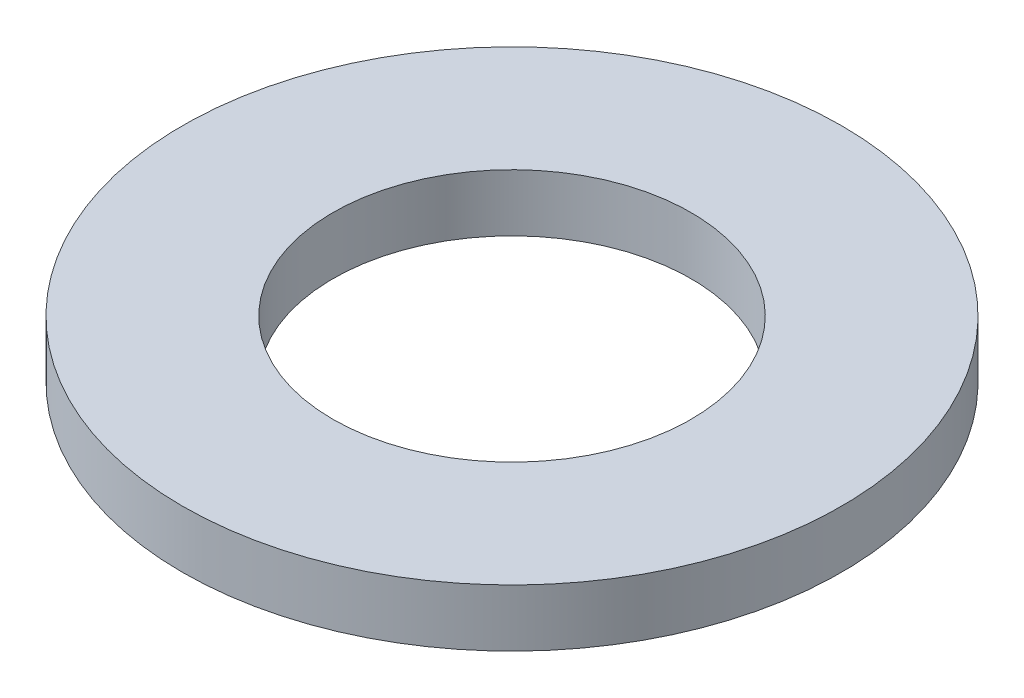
ISO-10303-21;
HEADER;
FILE_DESCRIPTION(('STEP AP214'),'2;1');
FILE_NAME('part.step','',(''),(''),'','','');
FILE_SCHEMA(('AUTOMOTIVE_DESIGN { 1 0 10303 214 1 1 1 1 }'));
ENDSEC;
DATA;
#1=APPLICATION_CONTEXT('core data for automotive mechanical design processes');
#2=APPLICATION_PROTOCOL_DEFINITION('international standard','automotive_design',2000,#1);
#3=PRODUCT_CONTEXT('',#1,'mechanical');
#4=PRODUCT('Part','Part','',(#3));
#5=PRODUCT_RELATED_PRODUCT_CATEGORY('part','',(#4));
#6=PRODUCT_DEFINITION_FORMATION('','',#4);
#7=PRODUCT_DEFINITION_CONTEXT('part definition',#1,'design');
#8=PRODUCT_DEFINITION('design','',#6,#7);
#9=PRODUCT_DEFINITION_SHAPE('','',#8);
#10=(LENGTH_UNIT() NAMED_UNIT(*) SI_UNIT(.MILLI.,.METRE.));
#11=(NAMED_UNIT(*) PLANE_ANGLE_UNIT() SI_UNIT($,.RADIAN.));
#12=(NAMED_UNIT(*) SI_UNIT($,.STERADIAN.) SOLID_ANGLE_UNIT());
#13=UNCERTAINTY_MEASURE_WITH_UNIT(LENGTH_MEASURE(1.E-05),#10,'distance_accuracy_value','');
#14=(GEOMETRIC_REPRESENTATION_CONTEXT(3) GLOBAL_UNCERTAINTY_ASSIGNED_CONTEXT((#13)) GLOBAL_UNIT_ASSIGNED_CONTEXT((#10,
#11,#12)) REPRESENTATION_CONTEXT('',''));
#15=CARTESIAN_POINT('',(0.,0.,0.));
#16=DIRECTION('',(0.,0.,1.));
#17=DIRECTION('',(1.,0.,0.));
#18=AXIS2_PLACEMENT_3D('',#15,#16,#17);
#19=CARTESIAN_POINT('',(0.,8.,0.));
#20=DIRECTION('',(0.,1.,0.));
#21=DIRECTION('',(0.,0.,1.));
#22=AXIS2_PLACEMENT_3D('',#19,#20,#21);
#23=PLANE('',#22);
#24=CARTESIAN_POINT('',(0.,8.,0.));
#25=DIRECTION('',(0.,1.,0.));
#26=DIRECTION('',(0.,0.,1.));
#27=AXIS2_PLACEMENT_3D('',#24,#25,#26);
#28=CIRCLE('',#27,46.);
#29=CARTESIAN_POINT('',(0.,8.,46.));
#30=VERTEX_POINT('',#29);
#31=EDGE_CURVE('E10',#30,#30,#28,.T.);
#32=ORIENTED_EDGE('',*,*,#31,.T.);
#33=EDGE_LOOP('',(#32));
#34=FACE_BOUND('',#33,.T.);
#35=CARTESIAN_POINT('',(0.,8.,0.));
#36=DIRECTION('',(0.,1.,0.));
#37=DIRECTION('',(0.,0.,1.));
#38=AXIS2_PLACEMENT_3D('',#35,#36,#37);
#39=CIRCLE('',#38,25.);
#40=CARTESIAN_POINT('',(0.,8.,25.));
#41=VERTEX_POINT('',#40);
#42=EDGE_CURVE('E39',#41,#41,#39,.T.);
#43=ORIENTED_EDGE('',*,*,#42,.F.);
#44=EDGE_LOOP('',(#43));
#45=FACE_BOUND('',#44,.T.);
#46=ADVANCED_FACE('F28',(#34,#45),#23,.T.);
#47=CARTESIAN_POINT('',(0.,0.,0.));
#48=DIRECTION('',(0.,1.,0.));
#49=DIRECTION('',(0.,0.,1.));
#50=AXIS2_PLACEMENT_3D('',#47,#48,#49);
#51=PLANE('',#50);
#52=CARTESIAN_POINT('',(0.,0.,0.));
#53=DIRECTION('',(0.,1.,0.));
#54=DIRECTION('',(0.,0.,1.));
#55=AXIS2_PLACEMENT_3D('',#52,#53,#54);
#56=CIRCLE('',#55,46.);
#57=CARTESIAN_POINT('',(0.,0.,46.));
#58=VERTEX_POINT('',#57);
#59=EDGE_CURVE('E35',#58,#58,#56,.T.);
#60=ORIENTED_EDGE('',*,*,#59,.F.);
#61=EDGE_LOOP('',(#60));
#62=FACE_BOUND('',#61,.T.);
#63=CARTESIAN_POINT('',(0.,0.,0.));
#64=DIRECTION('',(0.,1.,0.));
#65=DIRECTION('',(0.,0.,1.));
#66=AXIS2_PLACEMENT_3D('',#63,#64,#65);
#67=CIRCLE('',#66,25.);
#68=CARTESIAN_POINT('',(0.,0.,25.));
#69=VERTEX_POINT('',#68);
#70=EDGE_CURVE('E43',#69,#69,#67,.T.);
#71=ORIENTED_EDGE('',*,*,#70,.T.);
#72=EDGE_LOOP('',(#71));
#73=FACE_BOUND('',#72,.T.);
#74=ADVANCED_FACE('F49',(#62,#73),#51,.F.);
#75=CARTESIAN_POINT('',(0.,8.,0.));
#76=DIRECTION('',(0.,-1.,0.));
#77=DIRECTION('',(0.,0.,-1.));
#78=AXIS2_PLACEMENT_3D('',#75,#76,#77);
#79=CYLINDRICAL_SURFACE('',#78,46.);
#80=ORIENTED_EDGE('',*,*,#31,.F.);
#81=EDGE_LOOP('',(#80));
#82=FACE_BOUND('',#81,.T.);
#83=ORIENTED_EDGE('',*,*,#59,.T.);
#84=EDGE_LOOP('',(#83));
#85=FACE_BOUND('',#84,.T.);
#86=ADVANCED_FACE('F30',(#82,#85),#79,.T.);
#87=CARTESIAN_POINT('',(0.,8.,0.));
#88=DIRECTION('',(0.,-1.,0.));
#89=DIRECTION('',(0.,0.,-1.));
#90=AXIS2_PLACEMENT_3D('',#87,#88,#89);
#91=CYLINDRICAL_SURFACE('',#90,25.);
#92=ORIENTED_EDGE('',*,*,#42,.T.);
#93=EDGE_LOOP('',(#92));
#94=FACE_BOUND('',#93,.T.);
#95=ORIENTED_EDGE('',*,*,#70,.F.);
#96=EDGE_LOOP('',(#95));
#97=FACE_BOUND('',#96,.T.);
#98=ADVANCED_FACE('F51',(#94,#97),#91,.F.);
#99=CLOSED_SHELL('',(#46,#74,#86,#98));
#100=MANIFOLD_SOLID_BREP('B2',#99);
#101=ADVANCED_BREP_SHAPE_REPRESENTATION('',(#18,#100),#14);
#102=SHAPE_DEFINITION_REPRESENTATION(#9,#101);
ENDSEC;
END-ISO-10303-21;
